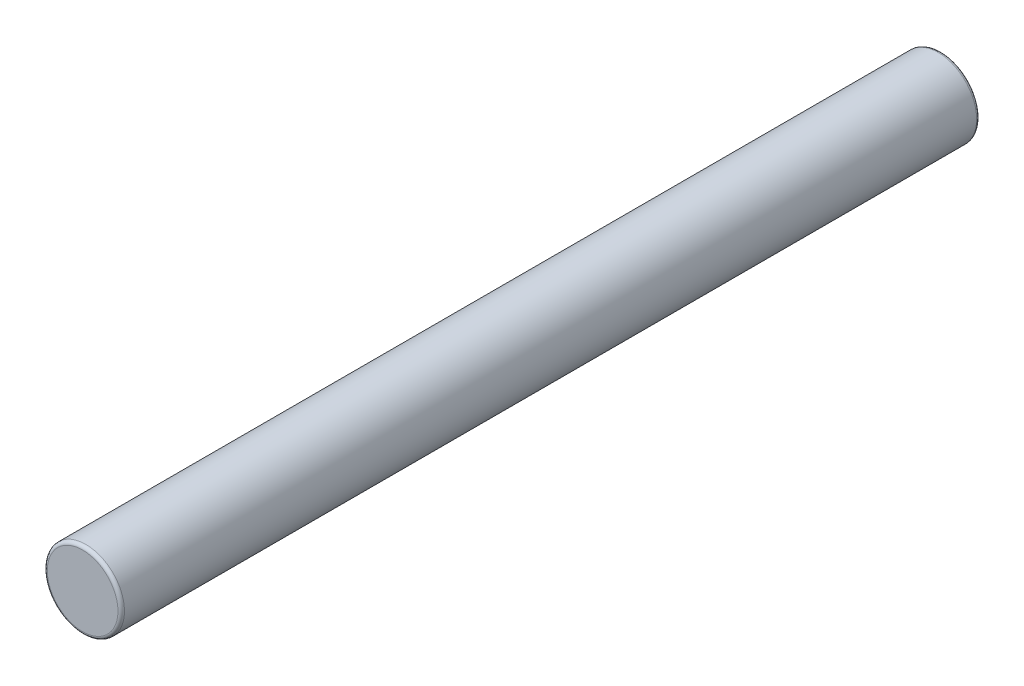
from build123d import *

# Parameters (mm, degrees)
SKETCH1_R      = 1.50495
EXTRUDE1_DEPTH = 16.7386
FILLET1_R      = 0.127


with BuildPart() as part:
    # Sketch1 → Extrude1 (new, symmetric)
    with BuildSketch(Plane.XY):
        Circle(SKETCH1_R)
    extrude(amount=EXTRUDE1_DEPTH, both=True)

    # Fillet1
    fillet1_edges = [part.edges().sort_by_distance(p)[0] for p in [
        (-1.50495, 0, -16.7386),
        (-1.50495, 0, 16.7386),
    ]]
    fillet(fillet1_edges, radius=FILLET1_R)


solid = part.part
